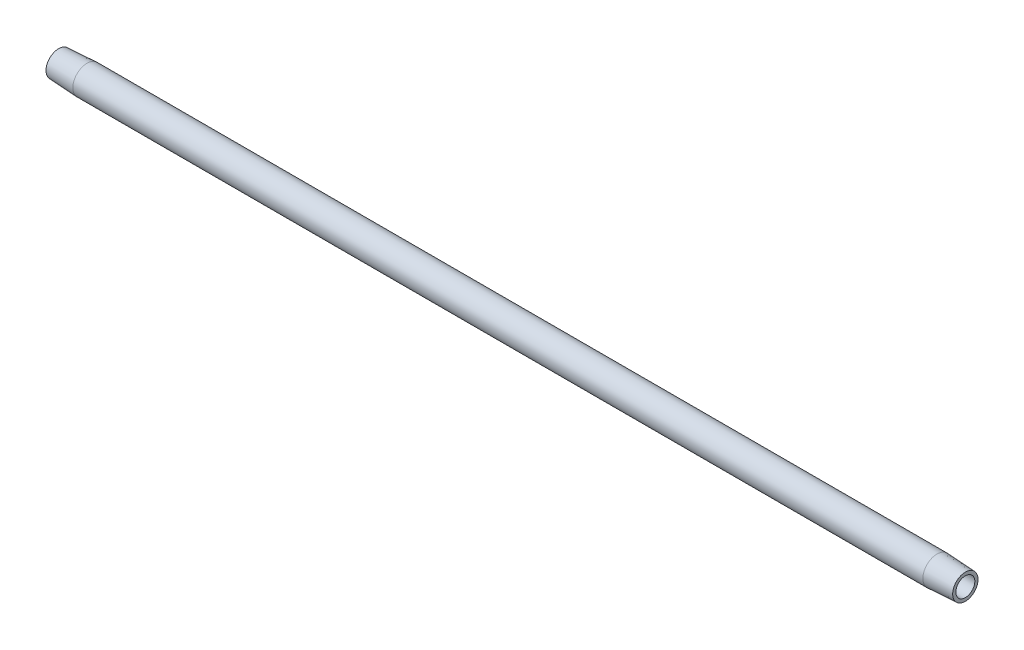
from build123d import *


with BuildPart() as part:
    # Sketch2 → Revolve1 (revolve)
    with BuildSketch(Plane.XY, mode=Mode.PRIVATE) as revolve1_sk:
        Polygon((7.9375, 3.96875), (0, 3.552763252), (0, 2.6543), (254, 2.6543), (254, 3.552763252), (246.0625, 3.96875), align=None)
    revolve(revolve1_sk.sketch.rotate(Axis((0.476141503, 0, 0), (1, 0, 0)), 90), axis=Axis((0.476141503, 0, 0), (1, 0, 0)))


solid = part.part
